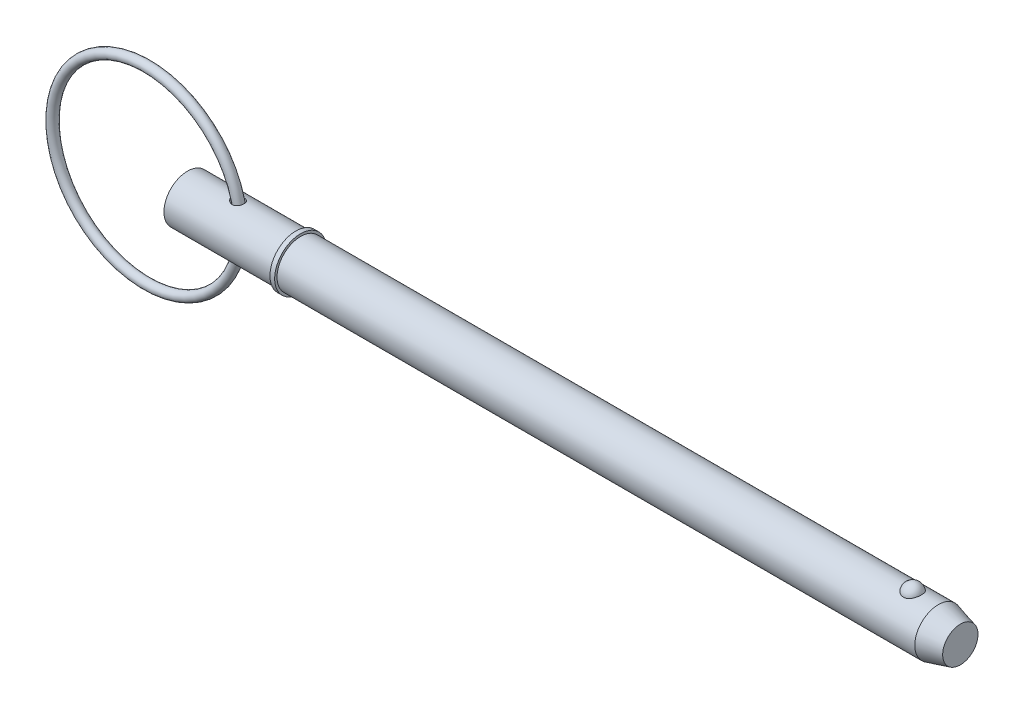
ISO-10303-21;
HEADER;
FILE_DESCRIPTION(('STEP AP214'),'2;1');
FILE_NAME('part.step','',(''),(''),'','','');
FILE_SCHEMA(('AUTOMOTIVE_DESIGN { 1 0 10303 214 1 1 1 1 }'));
ENDSEC;
DATA;
#1=APPLICATION_CONTEXT('core data for automotive mechanical design processes');
#2=APPLICATION_PROTOCOL_DEFINITION('international standard','automotive_design',2000,#1);
#3=PRODUCT_CONTEXT('',#1,'mechanical');
#4=PRODUCT('Part','Part','',(#3));
#5=PRODUCT_RELATED_PRODUCT_CATEGORY('part','',(#4));
#6=PRODUCT_DEFINITION_FORMATION('','',#4);
#7=PRODUCT_DEFINITION_CONTEXT('part definition',#1,'design');
#8=PRODUCT_DEFINITION('design','',#6,#7);
#9=PRODUCT_DEFINITION_SHAPE('','',#8);
#10=(LENGTH_UNIT() NAMED_UNIT(*) SI_UNIT(.MILLI.,.METRE.));
#11=(NAMED_UNIT(*) PLANE_ANGLE_UNIT() SI_UNIT($,.RADIAN.));
#12=(NAMED_UNIT(*) SI_UNIT($,.STERADIAN.) SOLID_ANGLE_UNIT());
#13=UNCERTAINTY_MEASURE_WITH_UNIT(LENGTH_MEASURE(1.E-05),#10,'distance_accuracy_value','');
#14=(GEOMETRIC_REPRESENTATION_CONTEXT(3) GLOBAL_UNCERTAINTY_ASSIGNED_CONTEXT((#13)) GLOBAL_UNIT_ASSIGNED_CONTEXT((#10,
#11,#12)) REPRESENTATION_CONTEXT('',''));
#15=CARTESIAN_POINT('',(0.,0.,0.));
#16=DIRECTION('',(0.,0.,1.));
#17=DIRECTION('',(1.,0.,0.));
#18=AXIS2_PLACEMENT_3D('',#15,#16,#17);
#19=CARTESIAN_POINT('',(-6.86864682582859,0.,0.));
#20=DIRECTION('',(0.,0.,1.));
#21=DIRECTION('',(1.,0.,0.));
#22=AXIS2_PLACEMENT_3D('',#19,#20,#21);
#23=TOROIDAL_SURFACE('',#22,15.875,0.794);
#24=CARTESIAN_POINT('',(9.80035317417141,0.,0.));
#25=VERTEX_POINT('',#24);
#26=VERTEX_LOOP('',#25);
#27=FACE_BOUND('',#26,.T.);
#28=ADVANCED_FACE('P0_F12',(#27),#23,.T.);
#29=CLOSED_SHELL('',(#28));
#30=MANIFOLD_SOLID_BREP('P0_B1',#29);
#31=CARTESIAN_POINT('',(0.,0.,0.));
#32=DIRECTION('',(1.,0.,0.));
#33=DIRECTION('',(0.,0.,-1.));
#34=AXIS2_PLACEMENT_3D('',#31,#32,#33);
#35=CYLINDRICAL_SURFACE('',#34,3.97);
#36=CARTESIAN_POINT('',(7.49679817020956,3.96502331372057,-0.198721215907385));
#37=CARTESIAN_POINT('',(7.50881508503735,3.96235594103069,-0.251916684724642));
#38=CARTESIAN_POINT('',(7.52561550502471,3.95866151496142,-0.304017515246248));
#39=CARTESIAN_POINT('',(7.56786984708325,3.9496659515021,-0.40447153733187));
#40=CARTESIAN_POINT('',(7.59333797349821,3.94436217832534,-0.452818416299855));
#41=CARTESIAN_POINT('',(7.65162192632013,3.93277091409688,-0.544364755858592));
#42=CARTESIAN_POINT('',(7.68440149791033,3.92648832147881,-0.587588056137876));
#43=CARTESIAN_POINT('',(7.75622109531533,3.91354812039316,-0.668369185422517));
#44=CARTESIAN_POINT('',(7.79526077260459,3.90689053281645,-0.705927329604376));
#45=CARTESIAN_POINT('',(7.88192852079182,3.8932854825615,-0.777603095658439));
#46=CARTESIAN_POINT('',(7.92999678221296,3.88635845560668,-0.811192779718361));
#47=CARTESIAN_POINT('',(8.03094744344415,3.87352417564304,-0.870420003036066));
#48=CARTESIAN_POINT('',(8.08383192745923,3.86761736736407,-0.896054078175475));
#49=CARTESIAN_POINT('',(8.19632733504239,3.85719062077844,-0.939958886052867));
#50=CARTESIAN_POINT('',(8.25615064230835,3.85277154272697,-0.957713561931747));
#51=CARTESIAN_POINT('',(8.37807849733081,3.84644428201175,-0.982821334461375));
#52=CARTESIAN_POINT('',(8.44018249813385,3.84453550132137,-0.990176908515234));
#53=CARTESIAN_POINT('',(8.56256649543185,3.84359535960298,-0.993820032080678));
#54=CARTESIAN_POINT('',(8.62283390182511,3.84446524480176,-0.990487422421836));
#55=CARTESIAN_POINT('',(8.74175397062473,3.84884648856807,-0.973323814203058));
#56=CARTESIAN_POINT('',(8.8004073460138,3.85235666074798,-0.959497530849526));
#57=CARTESIAN_POINT('',(8.91034168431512,3.86130428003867,-0.922798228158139));
#58=CARTESIAN_POINT('',(8.96185380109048,3.86659969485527,-0.900580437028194));
#59=CARTESIAN_POINT('',(9.06016940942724,3.87853590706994,-0.847697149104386));
#60=CARTESIAN_POINT('',(9.10697344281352,3.88517654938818,-0.817032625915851));
#61=CARTESIAN_POINT('',(9.19340982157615,3.89885483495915,-0.748999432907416));
#62=CARTESIAN_POINT('',(9.23319345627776,3.90587821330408,-0.711819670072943));
#63=CARTESIAN_POINT('',(9.30598310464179,3.91969783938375,-0.631295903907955));
#64=CARTESIAN_POINT('',(9.33898892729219,3.92649408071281,-0.587951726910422));
#65=CARTESIAN_POINT('',(9.39769437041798,3.939185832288,-0.495874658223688));
#66=CARTESIAN_POINT('',(9.42332322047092,3.94507238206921,-0.447095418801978));
#67=CARTESIAN_POINT('',(9.46625710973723,3.9552342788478,-0.345845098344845));
#68=CARTESIAN_POINT('',(9.48356178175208,3.95950955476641,-0.293373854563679));
#69=CARTESIAN_POINT('',(9.50956700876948,3.96602451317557,-0.185698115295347));
#70=CARTESIAN_POINT('',(9.51818595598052,3.96824487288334,-0.13047272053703));
#71=CARTESIAN_POINT('',(9.52633336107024,3.97034220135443,-0.0193113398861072));
#72=CARTESIAN_POINT('',(9.52586171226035,3.97021914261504,0.0366246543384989));
#73=CARTESIAN_POINT('',(9.51583327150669,3.9676413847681,0.147685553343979));
#74=CARTESIAN_POINT('',(9.50626624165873,3.96518405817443,0.202809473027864));
#75=CARTESIAN_POINT('',(9.47825604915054,3.95819854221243,0.310618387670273));
#76=CARTESIAN_POINT('',(9.45981267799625,3.95367030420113,0.36330332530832));
#77=CARTESIAN_POINT('',(9.41448405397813,3.94303435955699,0.464739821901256));
#78=CARTESIAN_POINT('',(9.38759833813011,3.93692656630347,0.51349116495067));
#79=CARTESIAN_POINT('',(9.32603556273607,3.92380455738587,0.605663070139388));
#80=CARTESIAN_POINT('',(9.29135869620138,3.91679036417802,0.649083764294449));
#81=CARTESIAN_POINT('',(9.21526329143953,3.90267522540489,0.729160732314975));
#82=CARTESIAN_POINT('',(9.17387556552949,3.89557480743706,0.765846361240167));
#83=CARTESIAN_POINT('',(9.08536362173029,3.88206315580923,0.831635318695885));
#84=CARTESIAN_POINT('',(9.03824022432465,3.8756518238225,0.860739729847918));
#85=CARTESIAN_POINT('',(8.94022154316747,3.86431915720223,0.910262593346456));
#86=CARTESIAN_POINT('',(8.88938101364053,3.85938013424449,0.930785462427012));
#87=CARTESIAN_POINT('',(8.78488780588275,3.85141510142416,0.96321476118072));
#88=CARTESIAN_POINT('',(8.73123520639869,3.84838903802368,0.975121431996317));
#89=CARTESIAN_POINT('',(8.62249427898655,3.84453017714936,0.990226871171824));
#90=CARTESIAN_POINT('',(8.56740225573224,3.84370373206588,0.993400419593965));
#91=CARTESIAN_POINT('',(8.45741104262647,3.8442816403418,0.991160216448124));
#92=CARTESIAN_POINT('',(8.40251189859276,3.84568649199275,0.98574454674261));
#93=CARTESIAN_POINT('',(8.29176880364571,3.85062289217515,0.966285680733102));
#94=CARTESIAN_POINT('',(8.23599684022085,3.85424894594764,0.951858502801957));
#95=CARTESIAN_POINT('',(8.12747212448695,3.86325492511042,0.91461785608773));
#96=CARTESIAN_POINT('',(8.0747205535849,3.86863553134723,0.891801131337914));
#97=CARTESIAN_POINT('',(7.97015235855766,3.88095261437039,0.836633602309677));
#98=CARTESIAN_POINT('',(7.91862083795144,3.88796764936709,0.803758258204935));
#99=CARTESIAN_POINT('',(7.82179253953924,3.90250904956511,0.729888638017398));
#100=CARTESIAN_POINT('',(7.77649765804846,3.91003556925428,0.688891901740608));
#101=CARTESIAN_POINT('',(7.69332536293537,3.92478114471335,0.599225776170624));
#102=CARTESIAN_POINT('',(7.6555122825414,3.93199714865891,0.550495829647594));
#103=CARTESIAN_POINT('',(7.5894819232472,3.94512912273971,0.446741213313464));
#104=CARTESIAN_POINT('',(7.56125849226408,3.95104592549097,0.391720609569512));
#105=CARTESIAN_POINT('',(7.51806227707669,3.9603062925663,0.282172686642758));
#106=CARTESIAN_POINT('',(7.50213211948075,3.96383230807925,0.228039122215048));
#107=CARTESIAN_POINT('',(7.48057398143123,3.96863642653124,0.117706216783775));
#108=CARTESIAN_POINT('',(7.47492746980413,3.96991857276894,0.0615107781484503));
#109=CARTESIAN_POINT('',(7.47437932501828,3.97004395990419,-0.0289758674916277));
#110=CARTESIAN_POINT('',(7.47615129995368,3.96964216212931,-0.0632805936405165));
#111=CARTESIAN_POINT('',(7.48358566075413,3.96796978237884,-0.131441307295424));
#112=CARTESIAN_POINT('',(7.48924767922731,3.96669928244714,-0.165297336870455));
#113=CARTESIAN_POINT('',(7.49679817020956,3.96502331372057,-0.198721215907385));
#114=B_SPLINE_CURVE_WITH_KNOTS('',3,(#36,#37,#38,#39,#40,#41,#42,#43,#44,#45,#46,#47,#48,#49,
#50,#51,#52,#53,#54,#55,#56,#57,#58,#59,#60,#61,#62,#63,#64,#65,#66,#67,#68,#69,#70,#71,#72,#73,
#74,#75,#76,#77,#78,#79,#80,#81,#82,#83,#84,#85,#86,#87,#88,#89,#90,#91,#92,#93,#94,#95,#96,#97,
#98,#99,#100,#101,#102,#103,#104,#105,#106,#107,#108,#109,#110,#111,#112,#113),.UNSPECIFIED.,
.T.,.F.,(4,2,2,2,2,2,2,2,2,2,2,2,2,2,2,2,2,2,2,2,2,2,2,2,2,2,2,2,2,2,2,2,2,2,2,2,2,2,4),(0.,
0.163661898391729,0.327593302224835,0.490729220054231,0.653856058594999,0.830244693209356,
1.00671002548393,1.1934572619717,1.38016000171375,1.56030212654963,1.74036335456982,
1.90857505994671,2.07676738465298,2.24071128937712,2.40465981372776,2.57013239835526,
2.73561228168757,2.90263284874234,3.06965537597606,3.23686612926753,3.40408081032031,
3.5713046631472,3.73852437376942,3.90499698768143,4.07144581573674,4.2358058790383,
4.40016134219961,4.56499094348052,4.72985735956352,4.90227873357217,5.0747670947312,
5.25849939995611,5.44228744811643,5.62759301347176,5.81277947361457,5.98144776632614,
6.14981181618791,6.25265388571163,6.35548624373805),.UNSPECIFIED.);
#115=CARTESIAN_POINT('',(7.49679817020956,3.96502331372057,-0.198721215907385));
#116=VERTEX_POINT('',#115);
#117=EDGE_CURVE('P1_E42',#116,#116,#114,.T.);
#118=ORIENTED_EDGE('',*,*,#117,.T.);
#119=EDGE_LOOP('',(#118));
#120=FACE_BOUND('',#119,.T.);
#121=CARTESIAN_POINT('',(0.,0.,0.));
#122=DIRECTION('',(1.,0.,0.));
#123=DIRECTION('',(0.,0.,-1.));
#124=AXIS2_PLACEMENT_3D('',#121,#122,#123);
#125=CIRCLE('',#124,3.97);
#126=CARTESIAN_POINT('',(0.,0.,-3.97));
#127=VERTEX_POINT('',#126);
#128=EDGE_CURVE('P1_E9',#127,#127,#125,.T.);
#129=ORIENTED_EDGE('',*,*,#128,.T.);
#130=EDGE_LOOP('',(#129));
#131=FACE_BOUND('',#130,.T.);
#132=CARTESIAN_POINT('',(18.256,0.,0.));
#133=DIRECTION('',(1.,0.,0.));
#134=DIRECTION('',(0.,0.,-1.));
#135=AXIS2_PLACEMENT_3D('',#132,#133,#134);
#136=CIRCLE('',#135,3.97);
#137=CARTESIAN_POINT('',(18.256,0.,-3.97));
#138=VERTEX_POINT('',#137);
#139=EDGE_CURVE('P1_E25',#138,#138,#136,.T.);
#140=ORIENTED_EDGE('',*,*,#139,.F.);
#141=EDGE_LOOP('',(#140));
#142=FACE_BOUND('',#141,.T.);
#143=CARTESIAN_POINT('',(7.49679817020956,-3.96502331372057,-0.198721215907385));
#144=CARTESIAN_POINT('',(7.48580986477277,-3.96746179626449,-0.150065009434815));
#145=CARTESIAN_POINT('',(7.47881617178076,-3.96904213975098,-0.100459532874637));
#146=CARTESIAN_POINT('',(7.47318383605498,-3.97031279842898,-0.000748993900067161));
#147=CARTESIAN_POINT('',(7.47454464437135,-3.97000323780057,0.049356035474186));
#148=CARTESIAN_POINT('',(7.48554252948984,-3.9675299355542,0.148550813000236));
#149=CARTESIAN_POINT('',(7.49517270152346,-3.9653677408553,0.197641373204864));
#150=CARTESIAN_POINT('',(7.5222068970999,-3.95942609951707,0.293523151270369));
#151=CARTESIAN_POINT('',(7.53961293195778,-3.9556462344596,0.340313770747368));
#152=CARTESIAN_POINT('',(7.58186218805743,-3.946757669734,0.431446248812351));
#153=CARTESIAN_POINT('',(7.6068526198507,-3.94162295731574,0.475716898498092));
#154=CARTESIAN_POINT('',(7.66318857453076,-3.93055115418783,0.559886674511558));
#155=CARTESIAN_POINT('',(7.69453617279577,-3.92461380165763,0.599784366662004));
#156=CARTESIAN_POINT('',(7.76618955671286,-3.91181958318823,0.678467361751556));
#157=CARTESIAN_POINT('',(7.80708710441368,-3.90493119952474,0.716708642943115));
#158=CARTESIAN_POINT('',(7.89431870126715,-3.89148185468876,0.786469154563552));
#159=CARTESIAN_POINT('',(7.94065563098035,-3.88492106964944,0.817984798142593));
#160=CARTESIAN_POINT('',(8.04208221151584,-3.87221514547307,0.876253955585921));
#161=CARTESIAN_POINT('',(8.09758465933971,-3.8661622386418,0.902312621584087));
#162=CARTESIAN_POINT('',(8.21228401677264,-3.855952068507,0.944996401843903));
#163=CARTESIAN_POINT('',(8.27148128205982,-3.85179498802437,0.961620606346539));
#164=CARTESIAN_POINT('',(8.39228716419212,-3.84593851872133,0.984786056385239));
#165=CARTESIAN_POINT('',(8.45390693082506,-3.84425231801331,0.991273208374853));
#166=CARTESIAN_POINT('',(8.57734686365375,-3.84370168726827,0.993408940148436));
#167=CARTESIAN_POINT('',(8.63916691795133,-3.84483588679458,0.989062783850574));
#168=CARTESIAN_POINT('',(8.75703619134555,-3.84970227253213,0.969937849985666));
#169=CARTESIAN_POINT('',(8.81320274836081,-3.85326512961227,0.955838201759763));
#170=CARTESIAN_POINT('',(8.92207486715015,-3.8624204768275,0.918140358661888));
#171=CARTESIAN_POINT('',(8.97478130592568,-3.86801245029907,0.89454458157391));
#172=CARTESIAN_POINT('',(9.07264210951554,-3.88024902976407,0.83982747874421));
#173=CARTESIAN_POINT('',(9.11803751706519,-3.88683023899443,0.809121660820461));
#174=CARTESIAN_POINT('',(9.20292513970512,-3.90048324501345,0.740506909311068));
#175=CARTESIAN_POINT('',(9.24241747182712,-3.90755503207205,0.702598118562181));
#176=CARTESIAN_POINT('',(9.31440361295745,-3.92139192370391,0.620727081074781));
#177=CARTESIAN_POINT('',(9.34691105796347,-3.9281576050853,0.576776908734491));
#178=CARTESIAN_POINT('',(9.40424150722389,-3.94066521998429,0.483990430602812));
#179=CARTESIAN_POINT('',(9.4290641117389,-3.94640710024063,0.435153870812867));
#180=CARTESIAN_POINT('',(9.47070060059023,-3.95631713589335,0.333318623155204));
#181=CARTESIAN_POINT('',(9.48741220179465,-3.96046506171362,0.280276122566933));
#182=CARTESIAN_POINT('',(9.51197570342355,-3.9666399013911,0.172058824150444));
#183=CARTESIAN_POINT('',(9.5198274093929,-3.96866676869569,0.116883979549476));
#184=CARTESIAN_POINT('',(9.52650209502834,-3.9703865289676,0.00572427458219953));
#185=CARTESIAN_POINT('',(9.52528754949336,-3.97006972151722,-0.0502629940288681));
#186=CARTESIAN_POINT('',(9.51376883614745,-3.96711300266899,-0.161232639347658));
#187=CARTESIAN_POINT('',(9.50346452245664,-3.96447305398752,-0.216214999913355));
#188=CARTESIAN_POINT('',(9.47400716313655,-3.95715440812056,-0.323616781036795));
#189=CARTESIAN_POINT('',(9.45485370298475,-3.95247561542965,-0.376036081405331));
#190=CARTESIAN_POINT('',(9.40815019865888,-3.94158766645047,-0.47682082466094));
#191=CARTESIAN_POINT('',(9.38060003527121,-3.93537848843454,-0.525186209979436));
#192=CARTESIAN_POINT('',(9.31780916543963,-3.92212278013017,-0.616423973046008));
#193=CARTESIAN_POINT('',(9.28257772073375,-3.91507726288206,-0.659302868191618));
#194=CARTESIAN_POINT('',(9.20530256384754,-3.90093459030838,-0.738394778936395));
#195=CARTESIAN_POINT('',(9.16325952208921,-3.8938374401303,-0.774608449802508));
#196=CARTESIAN_POINT('',(9.07394283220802,-3.88046830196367,-0.83901178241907));
#197=CARTESIAN_POINT('',(9.02672460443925,-3.87418889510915,-0.867276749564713));
#198=CARTESIAN_POINT('',(8.92806876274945,-3.86308015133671,-0.915492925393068));
#199=CARTESIAN_POINT('',(8.87663164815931,-3.85825064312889,-0.935445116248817));
#200=CARTESIAN_POINT('',(8.77150354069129,-3.85059630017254,-0.966469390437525));
#201=CARTESIAN_POINT('',(8.71783614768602,-3.84775433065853,-0.977617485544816));
#202=CARTESIAN_POINT('',(8.60934883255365,-3.84426767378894,-0.991239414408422));
#203=CARTESIAN_POINT('',(8.55452877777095,-3.84362324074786,-0.993712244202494));
#204=CARTESIAN_POINT('',(8.4438244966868,-3.84454392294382,-0.990144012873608));
#205=CARTESIAN_POINT('',(8.3879479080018,-3.84616465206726,-0.983888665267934));
#206=CARTESIAN_POINT('',(8.27791058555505,-3.85146784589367,-0.962917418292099));
#207=CARTESIAN_POINT('',(8.22375037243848,-3.85515092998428,-0.948198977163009));
#208=CARTESIAN_POINT('',(8.11503410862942,-3.86443542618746,-0.90964598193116));
#209=CARTESIAN_POINT('',(8.06067129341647,-3.87014379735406,-0.885291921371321));
#210=CARTESIAN_POINT('',(7.95661263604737,-3.88274545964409,-0.828274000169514));
#211=CARTESIAN_POINT('',(7.90691941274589,-3.88963940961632,-0.795605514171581));
#212=CARTESIAN_POINT('',(7.81143608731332,-3.90417480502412,-0.720990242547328));
#213=CARTESIAN_POINT('',(7.76592225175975,-3.9118359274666,-0.678692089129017));
#214=CARTESIAN_POINT('',(7.68309200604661,-3.926691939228,-0.586646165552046));
#215=CARTESIAN_POINT('',(7.6457689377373,-3.93388720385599,-0.536904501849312));
#216=CARTESIAN_POINT('',(7.58649683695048,-3.94577687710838,-0.440118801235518));
#217=CARTESIAN_POINT('',(7.56301593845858,-3.95068841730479,-0.394037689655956));
#218=CARTESIAN_POINT('',(7.52386335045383,-3.95904753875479,-0.298549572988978));
#219=CARTESIAN_POINT('',(7.5081856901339,-3.96249623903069,-0.249145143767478));
#220=CARTESIAN_POINT('',(7.49679817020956,-3.96502331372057,-0.198721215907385));
#221=B_SPLINE_CURVE_WITH_KNOTS('',3,(#143,#144,#145,#146,#147,#148,#149,#150,#151,#152,#153,
#154,#155,#156,#157,#158,#159,#160,#161,#162,#163,#164,#165,#166,#167,#168,#169,#170,#171,#172,
#173,#174,#175,#176,#177,#178,#179,#180,#181,#182,#183,#184,#185,#186,#187,#188,#189,#190,#191,
#192,#193,#194,#195,#196,#197,#198,#199,#200,#201,#202,#203,#204,#205,#206,#207,#208,#209,#210,
#211,#212,#213,#214,#215,#216,#217,#218,#219,#220),.UNSPECIFIED.,.T.,.F.,(4,2,2,2,2,2,2,2,2,2,2,
2,2,2,2,2,2,2,2,2,2,2,2,2,2,2,2,2,2,2,2,2,2,2,2,2,2,2,4),(0.,0.149644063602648,
0.299278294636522,0.448787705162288,0.598335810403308,0.750995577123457,0.903705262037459,
1.07224475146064,1.2408739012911,1.4248565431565,1.60885692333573,1.79383585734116,
1.97872492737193,2.15188813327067,2.32500727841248,2.489818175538,2.65462580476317,
2.81910871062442,2.98360017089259,3.15011526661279,3.31663401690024,3.48384236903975,
3.65105340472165,3.81827227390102,3.98549351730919,4.15251423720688,4.31951852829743,
4.48488279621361,4.65022752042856,4.81412860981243,4.97804866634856,5.14606470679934,
5.31413123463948,5.49286956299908,5.67170754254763,5.85859317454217,6.0453263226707,
6.20052601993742,6.35560677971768),.UNSPECIFIED.);
#222=CARTESIAN_POINT('',(7.49679817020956,-3.96502331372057,-0.198721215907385));
#223=VERTEX_POINT('',#222);
#224=EDGE_CURVE('P1_E17',#223,#223,#221,.T.);
#225=ORIENTED_EDGE('',*,*,#224,.T.);
#226=EDGE_LOOP('',(#225));
#227=FACE_BOUND('',#226,.T.);
#228=ADVANCED_FACE('P1_F13',(#120,#131,#142,#227),#35,.T.);
#229=CARTESIAN_POINT('',(0.,0.,0.));
#230=DIRECTION('',(1.,0.,0.));
#231=DIRECTION('',(0.,0.,-1.));
#232=AXIS2_PLACEMENT_3D('',#229,#230,#231);
#233=CYLINDRICAL_SURFACE('',#232,3.97);
#234=CARTESIAN_POINT('',(126.475939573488,0.,0.));
#235=DIRECTION('',(1.,0.,0.));
#236=DIRECTION('',(0.,0.,-1.));
#237=AXIS2_PLACEMENT_3D('',#234,#235,#236);
#238=CIRCLE('',#237,3.97);
#239=CARTESIAN_POINT('',(126.475939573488,0.,-3.97));
#240=VERTEX_POINT('',#239);
#241=EDGE_CURVE('P1_E99',#240,#240,#238,.T.);
#242=ORIENTED_EDGE('',*,*,#241,.F.);
#243=EDGE_LOOP('',(#242));
#244=FACE_BOUND('',#243,.T.);
#245=CARTESIAN_POINT('',(19.05,0.,0.));
#246=DIRECTION('',(1.,0.,0.));
#247=DIRECTION('',(0.,0.,-1.));
#248=AXIS2_PLACEMENT_3D('',#245,#246,#247);
#249=CIRCLE('',#248,3.97);
#250=CARTESIAN_POINT('',(19.05,0.,-3.97));
#251=VERTEX_POINT('',#250);
#252=EDGE_CURVE('P1_E96',#251,#251,#249,.T.);
#253=ORIENTED_EDGE('',*,*,#252,.T.);
#254=EDGE_LOOP('',(#253));
#255=FACE_BOUND('',#254,.T.);
#256=CARTESIAN_POINT('',(122.145192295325,3.65715365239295,1.5447094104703));
#257=CARTESIAN_POINT('',(122.065244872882,3.65716001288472,1.54470290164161));
#258=CARTESIAN_POINT('',(121.985165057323,3.65987074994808,1.53832549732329));
#259=CARTESIAN_POINT('',(121.827237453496,3.6704221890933,1.51297018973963));
#260=CARTESIAN_POINT('',(121.74939614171,3.67827646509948,1.49395894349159));
#261=CARTESIAN_POINT('',(121.598461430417,3.69818848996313,1.44395950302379));
#262=CARTESIAN_POINT('',(121.525356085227,3.71023513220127,1.41300293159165));
#263=CARTESIAN_POINT('',(121.385563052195,3.7372183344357,1.34000212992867));
#264=CARTESIAN_POINT('',(121.318872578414,3.75215363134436,1.29796274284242));
#265=CARTESIAN_POINT('',(121.19148864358,3.78384968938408,1.20248834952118));
#266=CARTESIAN_POINT('',(121.131029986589,3.80065129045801,1.14875388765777));
#267=CARTESIAN_POINT('',(121.019694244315,3.83398532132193,1.03205417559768));
#268=CARTESIAN_POINT('',(120.968820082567,3.85051766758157,0.969086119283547));
#269=CARTESIAN_POINT('',(120.875632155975,3.88238608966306,0.832526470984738));
#270=CARTESIAN_POINT('',(120.833796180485,3.89763698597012,0.758588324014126));
#271=CARTESIAN_POINT('',(120.762510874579,3.92451063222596,0.604352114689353));
#272=CARTESIAN_POINT('',(120.733062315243,3.93613315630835,0.524053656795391));
#273=CARTESIAN_POINT('',(120.686892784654,3.95467606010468,0.358403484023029));
#274=CARTESIAN_POINT('',(120.670312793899,3.96154426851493,0.273006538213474));
#275=CARTESIAN_POINT('',(120.650756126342,3.96967008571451,0.10040860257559));
#276=CARTESIAN_POINT('',(120.647778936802,3.97092790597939,0.0132076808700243));
#277=CARTESIAN_POINT('',(120.655458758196,3.96771794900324,-0.159844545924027));
#278=CARTESIAN_POINT('',(120.666016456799,3.96329187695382,-0.245701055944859));
#279=CARTESIAN_POINT('',(120.70038009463,3.94923163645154,-0.414277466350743));
#280=CARTESIAN_POINT('',(120.724186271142,3.93959737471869,-0.496997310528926));
#281=CARTESIAN_POINT('',(120.78461142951,3.91607752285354,-0.657113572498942));
#282=CARTESIAN_POINT('',(120.821249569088,3.90218558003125,-0.73450182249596));
#283=CARTESIAN_POINT('',(120.906593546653,3.87158287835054,-0.881704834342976));
#284=CARTESIAN_POINT('',(120.955300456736,3.8548718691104,-0.951518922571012));
#285=CARTESIAN_POINT('',(121.064116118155,3.82028735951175,-1.08208159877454));
#286=CARTESIAN_POINT('',(121.124295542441,3.80240713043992,-1.14276958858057));
#287=CARTESIAN_POINT('',(121.254493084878,3.76758161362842,-1.2528243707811));
#288=CARTESIAN_POINT('',(121.324510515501,3.75063626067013,-1.30219195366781));
#289=CARTESIAN_POINT('',(121.47118160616,3.71998948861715,-1.38729709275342));
#290=CARTESIAN_POINT('',(121.547681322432,3.70623183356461,-1.42327904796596));
#291=CARTESIAN_POINT('',(121.706298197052,3.68323188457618,-1.48178996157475));
#292=CARTESIAN_POINT('',(121.7884132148,3.67398788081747,-1.50432401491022));
#293=CARTESIAN_POINT('',(121.951481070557,3.6615216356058,-1.53440939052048));
#294=CARTESIAN_POINT('',(122.032284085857,3.65801951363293,-1.54265826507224));
#295=CARTESIAN_POINT('',(122.19420850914,3.65657341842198,-1.54608423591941));
#296=CARTESIAN_POINT('',(122.275329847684,3.65862829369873,-1.5412640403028));
#297=CARTESIAN_POINT('',(122.432812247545,3.66788969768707,-1.51908474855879));
#298=CARTESIAN_POINT('',(122.509242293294,3.67492621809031,-1.50213925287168));
#299=CARTESIAN_POINT('',(122.658041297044,3.69318404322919,-1.4566698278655));
#300=CARTESIAN_POINT('',(122.730409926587,3.7044056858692,-1.42814496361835));
#301=CARTESIAN_POINT('',(122.870802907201,3.73012749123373,-1.35956319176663));
#302=CARTESIAN_POINT('',(122.938700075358,3.74469307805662,-1.31927107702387));
#303=CARTESIAN_POINT('',(123.066864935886,3.77545272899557,-1.22847440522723));
#304=CARTESIAN_POINT('',(123.127130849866,3.79164717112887,-1.17796747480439));
#305=CARTESIAN_POINT('',(123.241634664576,3.82490325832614,-1.0651926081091));
#306=CARTESIAN_POINT('',(123.295413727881,3.84196735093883,-1.0024591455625));
#307=CARTESIAN_POINT('',(123.392098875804,3.87439863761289,-0.868715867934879));
#308=CARTESIAN_POINT('',(123.435003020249,3.88976552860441,-0.797704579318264));
#309=CARTESIAN_POINT('',(123.510266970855,3.91771381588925,-0.646896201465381));
#310=CARTESIAN_POINT('',(123.54225322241,3.93019255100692,-0.566893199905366));
#311=CARTESIAN_POINT('',(123.593110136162,3.95043886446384,-0.402255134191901));
#312=CARTESIAN_POINT('',(123.611980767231,3.95820643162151,-0.317620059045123));
#313=CARTESIAN_POINT('',(123.63621625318,3.96823733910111,-0.146156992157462));
#314=CARTESIAN_POINT('',(123.641587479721,3.97050327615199,-0.0593300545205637));
#315=CARTESIAN_POINT('',(123.638730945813,3.96930811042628,0.114057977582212));
#316=CARTESIAN_POINT('',(123.630503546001,3.9658471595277,0.200619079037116));
#317=CARTESIAN_POINT('',(123.600706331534,3.95358562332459,0.37050665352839));
#318=CARTESIAN_POINT('',(123.57921294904,3.94481563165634,0.453848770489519));
#319=CARTESIAN_POINT('',(123.52338397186,3.92284586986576,0.615497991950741));
#320=CARTESIAN_POINT('',(123.489047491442,3.90964579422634,0.693804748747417));
#321=CARTESIAN_POINT('',(123.407970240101,3.88006987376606,0.843703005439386));
#322=CARTESIAN_POINT('',(123.361153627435,3.86367478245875,0.915249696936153));
#323=CARTESIAN_POINT('',(123.256189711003,3.82949741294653,1.04910810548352));
#324=CARTESIAN_POINT('',(123.198042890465,3.81171519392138,1.1114202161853));
#325=CARTESIAN_POINT('',(123.071743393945,3.77673366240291,1.22503948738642));
#326=CARTESIAN_POINT('',(123.003597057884,3.75953398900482,1.27635357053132));
#327=CARTESIAN_POINT('',(122.858900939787,3.72770506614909,1.36653336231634));
#328=CARTESIAN_POINT('',(122.782348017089,3.7130767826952,1.40539439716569));
#329=CARTESIAN_POINT('',(122.625759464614,3.68864287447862,1.46830480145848));
#330=CARTESIAN_POINT('',(122.545930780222,3.67869017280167,1.49281289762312));
#331=CARTESIAN_POINT('',(122.382987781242,3.66414535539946,1.52817474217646));
#332=CARTESIAN_POINT('',(122.299884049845,3.65953723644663,1.53906926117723));
#333=CARTESIAN_POINT('',(122.192776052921,3.6573894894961,1.54414878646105));
#334=CARTESIAN_POINT('',(122.168990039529,3.65715175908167,1.54471134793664));
#335=CARTESIAN_POINT('',(122.145192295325,3.65715365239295,1.5447094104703));
#336=B_SPLINE_CURVE_WITH_KNOTS('',3,(#256,#257,#258,#259,#260,#261,#262,#263,#264,#265,#266,
#267,#268,#269,#270,#271,#272,#273,#274,#275,#276,#277,#278,#279,#280,#281,#282,#283,#284,#285,
#286,#287,#288,#289,#290,#291,#292,#293,#294,#295,#296,#297,#298,#299,#300,#301,#302,#303,#304,
#305,#306,#307,#308,#309,#310,#311,#312,#313,#314,#315,#316,#317,#318,#319,#320,#321,#322,#323,
#324,#325,#326,#327,#328,#329,#330,#331,#332,#333,#334,#335),.UNSPECIFIED.,.T.,.F.,(4,2,2,2,2,2,
2,2,2,2,2,2,2,2,2,2,2,2,2,2,2,2,2,2,2,2,2,2,2,2,2,2,2,2,2,2,2,2,2,4),(0.,0.239777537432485,
0.480190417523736,0.719971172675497,0.9596473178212,1.20639040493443,1.45320863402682,
1.71093679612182,1.9686809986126,2.22921052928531,2.48973023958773,2.74834928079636,
3.00697295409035,3.26598440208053,3.52501886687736,3.78570385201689,4.04637062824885,
4.30201257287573,4.55755760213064,4.80022994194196,5.04285200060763,5.27757006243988,
5.51230707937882,5.75210128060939,5.99195126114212,6.2439281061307,6.49594987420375,
6.75588818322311,7.01582710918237,7.27564332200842,7.53545264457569,7.79377886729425,
8.05212290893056,8.31207418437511,8.57201437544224,8.83179046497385,9.09166393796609,
9.34270057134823,9.59298357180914,9.66435753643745),.UNSPECIFIED.);
#337=CARTESIAN_POINT('',(122.145192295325,3.65715365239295,1.5447094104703));
#338=VERTEX_POINT('',#337);
#339=EDGE_CURVE('P1_E34',#338,#338,#336,.T.);
#340=ORIENTED_EDGE('',*,*,#339,.T.);
#341=EDGE_LOOP('',(#340));
#342=FACE_BOUND('',#341,.T.);
#343=ADVANCED_FACE('P1_F46',(#244,#255,#342),#233,.T.);
#344=CARTESIAN_POINT('',(0.,0.,0.));
#345=DIRECTION('',(-1.,0.,0.));
#346=DIRECTION('',(0.,0.,1.));
#347=AXIS2_PLACEMENT_3D('',#344,#345,#346);
#348=PLANE('',#347);
#349=ORIENTED_EDGE('',*,*,#128,.F.);
#350=EDGE_LOOP('',(#349));
#351=FACE_BOUND('',#350,.T.);
#352=ADVANCED_FACE('P1_F15',(#351),#348,.T.);
#353=CARTESIAN_POINT('',(18.256,3.97,0.));
#354=DIRECTION('',(-1.,0.,0.));
#355=DIRECTION('',(0.,0.,1.));
#356=AXIS2_PLACEMENT_3D('',#353,#354,#355);
#357=PLANE('',#356);
#358=ORIENTED_EDGE('',*,*,#139,.T.);
#359=EDGE_LOOP('',(#358));
#360=FACE_BOUND('',#359,.T.);
#361=CARTESIAN_POINT('',(18.256,0.,0.));
#362=DIRECTION('',(1.,0.,0.));
#363=DIRECTION('',(0.,0.,-1.));
#364=AXIS2_PLACEMENT_3D('',#361,#362,#363);
#365=CIRCLE('',#364,4.367);
#366=CARTESIAN_POINT('',(18.256,0.,-4.367));
#367=VERTEX_POINT('',#366);
#368=EDGE_CURVE('P1_E30',#367,#367,#365,.T.);
#369=ORIENTED_EDGE('',*,*,#368,.F.);
#370=EDGE_LOOP('',(#369));
#371=FACE_BOUND('',#370,.T.);
#372=ADVANCED_FACE('P1_F81',(#360,#371),#357,.T.);
#373=CARTESIAN_POINT('',(0.,0.,0.));
#374=DIRECTION('',(1.,0.,0.));
#375=DIRECTION('',(0.,0.,-1.));
#376=AXIS2_PLACEMENT_3D('',#373,#374,#375);
#377=CYLINDRICAL_SURFACE('',#376,4.367);
#378=ORIENTED_EDGE('',*,*,#368,.T.);
#379=EDGE_LOOP('',(#378));
#380=FACE_BOUND('',#379,.T.);
#381=CARTESIAN_POINT('',(19.05,0.,0.));
#382=DIRECTION('',(1.,0.,0.));
#383=DIRECTION('',(0.,0.,-1.));
#384=AXIS2_PLACEMENT_3D('',#381,#382,#383);
#385=CIRCLE('',#384,4.367);
#386=CARTESIAN_POINT('',(19.05,0.,-4.367));
#387=VERTEX_POINT('',#386);
#388=EDGE_CURVE('P1_E95',#387,#387,#385,.T.);
#389=ORIENTED_EDGE('',*,*,#388,.F.);
#390=EDGE_LOOP('',(#389));
#391=FACE_BOUND('',#390,.T.);
#392=ADVANCED_FACE('P1_F68',(#380,#391),#377,.T.);
#393=CARTESIAN_POINT('',(19.05,4.367,0.));
#394=DIRECTION('',(1.,0.,0.));
#395=DIRECTION('',(0.,0.,-1.));
#396=AXIS2_PLACEMENT_3D('',#393,#394,#395);
#397=PLANE('',#396);
#398=ORIENTED_EDGE('',*,*,#388,.T.);
#399=EDGE_LOOP('',(#398));
#400=FACE_BOUND('',#399,.T.);
#401=ORIENTED_EDGE('',*,*,#252,.F.);
#402=EDGE_LOOP('',(#401));
#403=FACE_BOUND('',#402,.T.);
#404=ADVANCED_FACE('P1_F62',(#400,#403),#397,.T.);
#405=CARTESIAN_POINT('',(130.18,0.,0.));
#406=DIRECTION('',(-1.,0.,0.));
#407=DIRECTION('',(0.,0.,1.));
#408=AXIS2_PLACEMENT_3D('',#405,#406,#407);
#409=CONICAL_SURFACE('',#408,2.97750000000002,0.261799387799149);
#410=ORIENTED_EDGE('',*,*,#241,.T.);
#411=EDGE_LOOP('',(#410));
#412=FACE_BOUND('',#411,.T.);
#413=CARTESIAN_POINT('',(130.18,0.,0.));
#414=DIRECTION('',(1.,0.,0.));
#415=DIRECTION('',(0.,0.,-1.));
#416=AXIS2_PLACEMENT_3D('',#413,#414,#415);
#417=CIRCLE('',#416,2.97750000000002);
#418=CARTESIAN_POINT('',(130.18,0.,-2.97750000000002));
#419=VERTEX_POINT('',#418);
#420=EDGE_CURVE('P1_E41',#419,#419,#417,.T.);
#421=ORIENTED_EDGE('',*,*,#420,.F.);
#422=EDGE_LOOP('',(#421));
#423=FACE_BOUND('',#422,.T.);
#424=ADVANCED_FACE('P1_F59',(#412,#423),#409,.T.);
#425=CARTESIAN_POINT('',(130.18,2.97750000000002,0.));
#426=DIRECTION('',(1.,0.,0.));
#427=DIRECTION('',(0.,0.,-1.));
#428=AXIS2_PLACEMENT_3D('',#425,#426,#427);
#429=PLANE('',#428);
#430=ORIENTED_EDGE('',*,*,#420,.T.);
#431=EDGE_LOOP('',(#430));
#432=FACE_BOUND('',#431,.T.);
#433=ADVANCED_FACE('P1_F55',(#432),#429,.T.);
#434=CARTESIAN_POINT('',(122.145192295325,3.57299999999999,0.));
#435=DIRECTION('',(-1.,0.,0.));
#436=DIRECTION('',(0.,1.,0.));
#437=AXIS2_PLACEMENT_3D('',#434,#435,#436);
#438=SPHERICAL_SURFACE('',#437,1.54700000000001);
#439=ORIENTED_EDGE('',*,*,#339,.F.);
#440=EDGE_LOOP('',(#439));
#441=FACE_BOUND('',#440,.T.);
#442=ADVANCED_FACE('P1_F50',(#441),#438,.T.);
#443=CARTESIAN_POINT('',(-6.86864682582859,0.,0.));
#444=DIRECTION('',(0.,0.,1.));
#445=DIRECTION('',(1.,0.,0.));
#446=AXIS2_PLACEMENT_3D('',#443,#444,#445);
#447=TOROIDAL_SURFACE('',#446,15.875,0.992500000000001);
#448=ORIENTED_EDGE('',*,*,#224,.F.);
#449=EDGE_LOOP('',(#448));
#450=FACE_BOUND('',#449,.T.);
#451=ORIENTED_EDGE('',*,*,#117,.F.);
#452=EDGE_LOOP('',(#451));
#453=FACE_BOUND('',#452,.T.);
#454=ADVANCED_FACE('P1_F54',(#450,#453),#447,.F.);
#455=CLOSED_SHELL('',(#228,#343,#352,#372,#392,#404,#424,#433,#442,#454));
#456=MANIFOLD_SOLID_BREP('P1_B1',#455);
#457=ADVANCED_BREP_SHAPE_REPRESENTATION('',(#18,#30,#456),#14);
#458=SHAPE_DEFINITION_REPRESENTATION(#9,#457);
ENDSEC;
END-ISO-10303-21;
